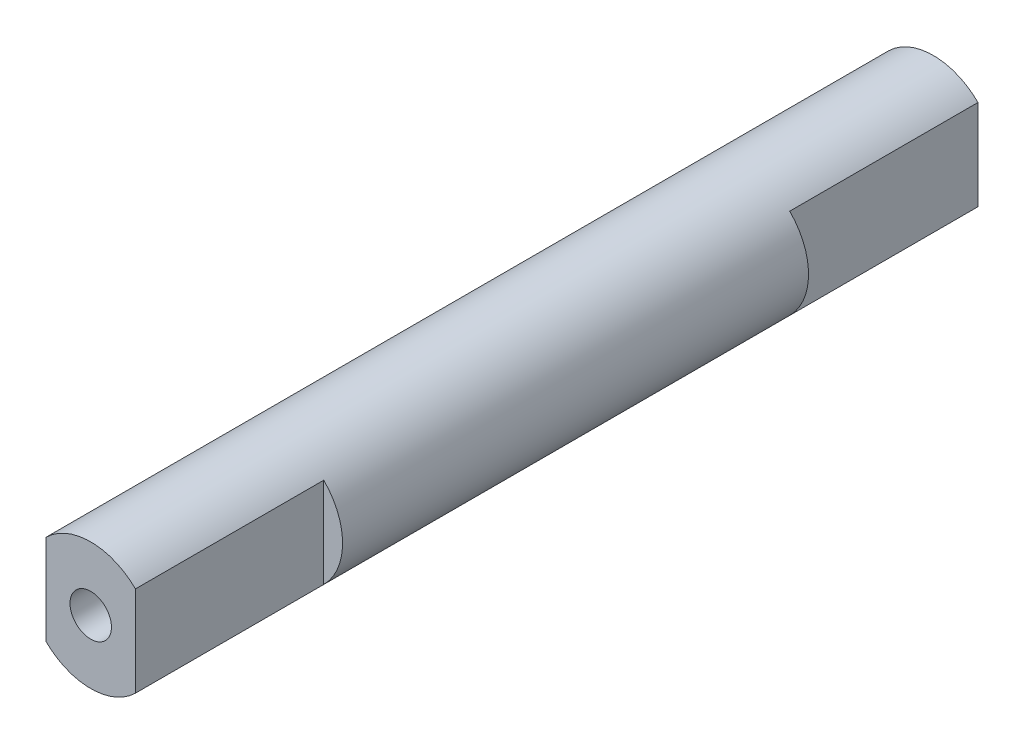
ISO-10303-21;
HEADER;
FILE_DESCRIPTION(('STEP AP214'),'2;1');
FILE_NAME('part.step','',(''),(''),'','','');
FILE_SCHEMA(('AUTOMOTIVE_DESIGN { 1 0 10303 214 1 1 1 1 }'));
ENDSEC;
DATA;
#1=APPLICATION_CONTEXT('core data for automotive mechanical design processes');
#2=APPLICATION_PROTOCOL_DEFINITION('international standard','automotive_design',2000,#1);
#3=PRODUCT_CONTEXT('',#1,'mechanical');
#4=PRODUCT('Part','Part','',(#3));
#5=PRODUCT_RELATED_PRODUCT_CATEGORY('part','',(#4));
#6=PRODUCT_DEFINITION_FORMATION('','',#4);
#7=PRODUCT_DEFINITION_CONTEXT('part definition',#1,'design');
#8=PRODUCT_DEFINITION('design','',#6,#7);
#9=PRODUCT_DEFINITION_SHAPE('','',#8);
#10=(LENGTH_UNIT() NAMED_UNIT(*) SI_UNIT(.MILLI.,.METRE.));
#11=(NAMED_UNIT(*) PLANE_ANGLE_UNIT() SI_UNIT($,.RADIAN.));
#12=(NAMED_UNIT(*) SI_UNIT($,.STERADIAN.) SOLID_ANGLE_UNIT());
#13=UNCERTAINTY_MEASURE_WITH_UNIT(LENGTH_MEASURE(1.E-05),#10,'distance_accuracy_value','');
#14=(GEOMETRIC_REPRESENTATION_CONTEXT(3) GLOBAL_UNCERTAINTY_ASSIGNED_CONTEXT((#13)) GLOBAL_UNIT_ASSIGNED_CONTEXT((#10,
#11,#12)) REPRESENTATION_CONTEXT('',''));
#15=CARTESIAN_POINT('',(0.,0.,0.));
#16=DIRECTION('',(0.,0.,1.));
#17=DIRECTION('',(1.,0.,0.));
#18=AXIS2_PLACEMENT_3D('',#15,#16,#17);
#19=CARTESIAN_POINT('',(0.,0.,-19.296));
#20=DIRECTION('',(0.,0.,-1.));
#21=DIRECTION('',(1.,0.,0.));
#22=AXIS2_PLACEMENT_3D('',#19,#20,#21);
#23=PLANE('',#22);
#24=CARTESIAN_POINT('',(0.,0.,-19.296));
#25=DIRECTION('',(0.,0.,1.));
#26=DIRECTION('',(1.,0.,0.));
#27=AXIS2_PLACEMENT_3D('',#24,#25,#26);
#28=CIRCLE('',#27,2.7);
#29=CARTESIAN_POINT('',(1.9,-1.91833260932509,-19.296));
#30=VERTEX_POINT('',#29);
#31=CARTESIAN_POINT('',(1.9,1.91833260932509,-19.296));
#32=VERTEX_POINT('',#31);
#33=EDGE_CURVE('E110',#30,#32,#28,.T.);
#34=ORIENTED_EDGE('',*,*,#33,.F.);
#35=DIRECTION('',(0.,1.,0.));
#36=VECTOR('',#35,1.);
#37=CARTESIAN_POINT('',(1.9,-1.91833260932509,-19.296));
#38=LINE('',#37,#36);
#39=EDGE_CURVE('E121',#30,#32,#38,.T.);
#40=ORIENTED_EDGE('',*,*,#39,.T.);
#41=EDGE_LOOP('',(#34,#40));
#42=FACE_BOUND('',#41,.T.);
#43=ADVANCED_FACE('F37',(#42),#23,.T.);
#44=CARTESIAN_POINT('',(-1.9,1.91833260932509,-19.296));
#45=VERTEX_POINT('',#44);
#46=CARTESIAN_POINT('',(-1.9,-1.91833260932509,-19.296));
#47=VERTEX_POINT('',#46);
#48=EDGE_CURVE('E109',#45,#47,#28,.T.);
#49=ORIENTED_EDGE('',*,*,#48,.F.);
#50=DIRECTION('',(0.,-1.,0.));
#51=VECTOR('',#50,1.);
#52=CARTESIAN_POINT('',(-1.9,-1.91833260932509,-19.296));
#53=LINE('',#52,#51);
#54=EDGE_CURVE('E136',#45,#47,#53,.T.);
#55=ORIENTED_EDGE('',*,*,#54,.T.);
#56=EDGE_LOOP('',(#49,#55));
#57=FACE_BOUND('',#56,.T.);
#58=ADVANCED_FACE('F215',(#57),#23,.T.);
#59=CARTESIAN_POINT('',(0.,0.,0.5));
#60=DIRECTION('',(0.,0.,1.));
#61=DIRECTION('',(1.,0.,0.));
#62=AXIS2_PLACEMENT_3D('',#59,#60,#61);
#63=PLANE('',#62);
#64=DIRECTION('',(0.,-1.,0.));
#65=VECTOR('',#64,1.);
#66=CARTESIAN_POINT('',(-1.9,-1.91833260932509,0.5));
#67=LINE('',#66,#65);
#68=CARTESIAN_POINT('',(-1.9,1.91833260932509,0.5));
#69=VERTEX_POINT('',#68);
#70=CARTESIAN_POINT('',(-1.9,-1.91833260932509,0.5));
#71=VERTEX_POINT('',#70);
#72=EDGE_CURVE('E158',#69,#71,#67,.T.);
#73=ORIENTED_EDGE('',*,*,#72,.F.);
#74=CARTESIAN_POINT('',(0.,0.,0.5));
#75=DIRECTION('',(0.,0.,1.));
#76=DIRECTION('',(1.,0.,0.));
#77=AXIS2_PLACEMENT_3D('',#74,#75,#76);
#78=CIRCLE('',#77,2.7);
#79=EDGE_CURVE('E11',#69,#71,#78,.T.);
#80=ORIENTED_EDGE('',*,*,#79,.T.);
#81=EDGE_LOOP('',(#73,#80));
#82=FACE_BOUND('',#81,.T.);
#83=ADVANCED_FACE('F207',(#82),#63,.T.);
#84=CARTESIAN_POINT('',(0.,0.,0.5));
#85=DIRECTION('',(0.,0.,-1.));
#86=DIRECTION('',(-1.,0.,0.));
#87=AXIS2_PLACEMENT_3D('',#84,#85,#86);
#88=CYLINDRICAL_SURFACE('',#87,2.7);
#89=ORIENTED_EDGE('',*,*,#79,.F.);
#90=DIRECTION('',(0.,0.,-1.));
#91=VECTOR('',#90,1.);
#92=CARTESIAN_POINT('',(-1.9,1.91833260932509,8.5));
#93=LINE('',#92,#91);
#94=CARTESIAN_POINT('',(-1.9,1.91833260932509,8.5));
#95=VERTEX_POINT('',#94);
#96=EDGE_CURVE('E165',#95,#69,#93,.T.);
#97=ORIENTED_EDGE('',*,*,#96,.F.);
#98=CARTESIAN_POINT('',(0.,0.,8.5));
#99=DIRECTION('',(0.,0.,1.));
#100=DIRECTION('',(1.,0.,0.));
#101=AXIS2_PLACEMENT_3D('',#98,#99,#100);
#102=CIRCLE('',#101,2.7);
#103=CARTESIAN_POINT('',(1.9,1.91833260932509,8.5));
#104=VERTEX_POINT('',#103);
#105=EDGE_CURVE('E237',#104,#95,#102,.T.);
#106=ORIENTED_EDGE('',*,*,#105,.F.);
#107=DIRECTION('',(0.,0.,-1.));
#108=VECTOR('',#107,1.);
#109=CARTESIAN_POINT('',(1.9,1.91833260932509,8.5));
#110=LINE('',#109,#108);
#111=CARTESIAN_POINT('',(1.9,1.91833260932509,0.5));
#112=VERTEX_POINT('',#111);
#113=EDGE_CURVE('E168',#104,#112,#110,.T.);
#114=ORIENTED_EDGE('',*,*,#113,.T.);
#115=CARTESIAN_POINT('',(1.9,-1.91833260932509,0.5));
#116=VERTEX_POINT('',#115);
#117=EDGE_CURVE('E46',#116,#112,#78,.T.);
#118=ORIENTED_EDGE('',*,*,#117,.F.);
#119=DIRECTION('',(0.,0.,-1.));
#120=VECTOR('',#119,1.);
#121=CARTESIAN_POINT('',(1.9,-1.91833260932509,8.5));
#122=LINE('',#121,#120);
#123=CARTESIAN_POINT('',(1.9,-1.91833260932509,8.5));
#124=VERTEX_POINT('',#123);
#125=EDGE_CURVE('E189',#124,#116,#122,.T.);
#126=ORIENTED_EDGE('',*,*,#125,.F.);
#127=CARTESIAN_POINT('',(0.,0.,8.5));
#128=DIRECTION('',(0.,0.,1.));
#129=DIRECTION('',(1.,0.,0.));
#130=AXIS2_PLACEMENT_3D('',#127,#128,#129);
#131=CIRCLE('',#130,2.7);
#132=CARTESIAN_POINT('',(-1.9,-1.91833260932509,8.5));
#133=VERTEX_POINT('',#132);
#134=EDGE_CURVE('E178',#133,#124,#131,.T.);
#135=ORIENTED_EDGE('',*,*,#134,.F.);
#136=DIRECTION('',(0.,0.,-1.));
#137=VECTOR('',#136,1.);
#138=CARTESIAN_POINT('',(-1.9,-1.91833260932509,8.5));
#139=LINE('',#138,#137);
#140=EDGE_CURVE('E169',#133,#71,#139,.T.);
#141=ORIENTED_EDGE('',*,*,#140,.T.);
#142=EDGE_LOOP('',(#89,#97,#106,#114,#118,#126,#135,#141));
#143=FACE_BOUND('',#142,.T.);
#144=ORIENTED_EDGE('',*,*,#33,.T.);
#145=DIRECTION('',(0.,0.,1.));
#146=VECTOR('',#145,1.);
#147=CARTESIAN_POINT('',(1.9,1.91833260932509,-27.296));
#148=LINE('',#147,#146);
#149=CARTESIAN_POINT('',(1.9,1.91833260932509,-27.296));
#150=VERTEX_POINT('',#149);
#151=EDGE_CURVE('E144',#150,#32,#148,.T.);
#152=ORIENTED_EDGE('',*,*,#151,.F.);
#153=CARTESIAN_POINT('',(0.,0.,-27.296));
#154=DIRECTION('',(0.,0.,1.));
#155=DIRECTION('',(1.,0.,0.));
#156=AXIS2_PLACEMENT_3D('',#153,#154,#155);
#157=CIRCLE('',#156,2.7);
#158=CARTESIAN_POINT('',(-1.9,1.91833260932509,-27.296));
#159=VERTEX_POINT('',#158);
#160=EDGE_CURVE('E124',#150,#159,#157,.T.);
#161=ORIENTED_EDGE('',*,*,#160,.T.);
#162=DIRECTION('',(0.,0.,1.));
#163=VECTOR('',#162,1.);
#164=CARTESIAN_POINT('',(-1.9,1.91833260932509,-27.296));
#165=LINE('',#164,#163);
#166=EDGE_CURVE('E111',#159,#45,#165,.T.);
#167=ORIENTED_EDGE('',*,*,#166,.T.);
#168=ORIENTED_EDGE('',*,*,#48,.T.);
#169=DIRECTION('',(0.,0.,1.));
#170=VECTOR('',#169,1.);
#171=CARTESIAN_POINT('',(-1.9,-1.91833260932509,-27.296));
#172=LINE('',#171,#170);
#173=CARTESIAN_POINT('',(-1.9,-1.91833260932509,-27.296));
#174=VERTEX_POINT('',#173);
#175=EDGE_CURVE('E54',#174,#47,#172,.T.);
#176=ORIENTED_EDGE('',*,*,#175,.F.);
#177=CARTESIAN_POINT('',(0.,0.,-27.296));
#178=DIRECTION('',(0.,0.,1.));
#179=DIRECTION('',(1.,0.,0.));
#180=AXIS2_PLACEMENT_3D('',#177,#178,#179);
#181=CIRCLE('',#180,2.7);
#182=CARTESIAN_POINT('',(1.9,-1.91833260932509,-27.296));
#183=VERTEX_POINT('',#182);
#184=EDGE_CURVE('E106',#174,#183,#181,.T.);
#185=ORIENTED_EDGE('',*,*,#184,.T.);
#186=DIRECTION('',(0.,0.,1.));
#187=VECTOR('',#186,1.);
#188=CARTESIAN_POINT('',(1.9,-1.91833260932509,-27.296));
#189=LINE('',#188,#187);
#190=EDGE_CURVE('E130',#183,#30,#189,.T.);
#191=ORIENTED_EDGE('',*,*,#190,.T.);
#192=EDGE_LOOP('',(#144,#152,#161,#167,#168,#176,#185,#191));
#193=FACE_BOUND('',#192,.T.);
#194=ADVANCED_FACE('F39',(#143,#193),#88,.T.);
#195=DIRECTION('',(0.,1.,0.));
#196=VECTOR('',#195,1.);
#197=CARTESIAN_POINT('',(1.9,-1.91833260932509,0.5));
#198=LINE('',#197,#196);
#199=EDGE_CURVE('E61',#116,#112,#198,.T.);
#200=ORIENTED_EDGE('',*,*,#199,.F.);
#201=ORIENTED_EDGE('',*,*,#117,.T.);
#202=EDGE_LOOP('',(#200,#201));
#203=FACE_BOUND('',#202,.T.);
#204=ADVANCED_FACE('F205',(#203),#63,.T.);
#205=CARTESIAN_POINT('',(1.9,-1.91833260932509,8.5));
#206=DIRECTION('',(-1.,0.,0.));
#207=DIRECTION('',(0.,0.,1.));
#208=AXIS2_PLACEMENT_3D('',#205,#206,#207);
#209=PLANE('',#208);
#210=ORIENTED_EDGE('',*,*,#199,.T.);
#211=ORIENTED_EDGE('',*,*,#113,.F.);
#212=DIRECTION('',(0.,1.,0.));
#213=VECTOR('',#212,1.);
#214=CARTESIAN_POINT('',(1.9,-1.91833260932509,8.5));
#215=LINE('',#214,#213);
#216=EDGE_CURVE('E199',#124,#104,#215,.T.);
#217=ORIENTED_EDGE('',*,*,#216,.F.);
#218=ORIENTED_EDGE('',*,*,#125,.T.);
#219=EDGE_LOOP('',(#210,#211,#217,#218));
#220=FACE_BOUND('',#219,.T.);
#221=ADVANCED_FACE('F197',(#220),#209,.F.);
#222=CARTESIAN_POINT('',(-1.9,-1.91833260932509,8.5));
#223=DIRECTION('',(1.,0.,0.));
#224=DIRECTION('',(0.,0.,-1.));
#225=AXIS2_PLACEMENT_3D('',#222,#223,#224);
#226=PLANE('',#225);
#227=ORIENTED_EDGE('',*,*,#72,.T.);
#228=ORIENTED_EDGE('',*,*,#140,.F.);
#229=DIRECTION('',(0.,-1.,0.));
#230=VECTOR('',#229,1.);
#231=CARTESIAN_POINT('',(-1.9,-1.91833260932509,8.5));
#232=LINE('',#231,#230);
#233=EDGE_CURVE('E174',#95,#133,#232,.T.);
#234=ORIENTED_EDGE('',*,*,#233,.F.);
#235=ORIENTED_EDGE('',*,*,#96,.T.);
#236=EDGE_LOOP('',(#227,#228,#234,#235));
#237=FACE_BOUND('',#236,.T.);
#238=ADVANCED_FACE('F212',(#237),#226,.F.);
#239=CARTESIAN_POINT('',(0.,0.,8.5));
#240=DIRECTION('',(0.,0.,1.));
#241=DIRECTION('',(1.,0.,0.));
#242=AXIS2_PLACEMENT_3D('',#239,#240,#241);
#243=PLANE('',#242);
#244=CARTESIAN_POINT('',(0.,0.,8.5));
#245=DIRECTION('',(0.,0.,1.));
#246=DIRECTION('',(1.,0.,0.));
#247=AXIS2_PLACEMENT_3D('',#244,#245,#246);
#248=CIRCLE('',#247,0.88);
#249=CARTESIAN_POINT('',(0.88,0.,8.5));
#250=VERTEX_POINT('',#249);
#251=EDGE_CURVE('E339',#250,#250,#248,.T.);
#252=ORIENTED_EDGE('',*,*,#251,.F.);
#253=EDGE_LOOP('',(#252));
#254=FACE_BOUND('',#253,.T.);
#255=ORIENTED_EDGE('',*,*,#134,.T.);
#256=ORIENTED_EDGE('',*,*,#216,.T.);
#257=ORIENTED_EDGE('',*,*,#105,.T.);
#258=ORIENTED_EDGE('',*,*,#233,.T.);
#259=EDGE_LOOP('',(#255,#256,#257,#258));
#260=FACE_BOUND('',#259,.T.);
#261=ADVANCED_FACE('F226',(#254,#260),#243,.T.);
#262=CARTESIAN_POINT('',(-1.9,-1.91833260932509,-27.296));
#263=DIRECTION('',(-1.,0.,0.));
#264=DIRECTION('',(0.,0.,1.));
#265=AXIS2_PLACEMENT_3D('',#262,#263,#264);
#266=PLANE('',#265);
#267=ORIENTED_EDGE('',*,*,#54,.F.);
#268=ORIENTED_EDGE('',*,*,#166,.F.);
#269=DIRECTION('',(0.,-1.,0.));
#270=VECTOR('',#269,1.);
#271=CARTESIAN_POINT('',(-1.9,-1.91833260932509,-27.296));
#272=LINE('',#271,#270);
#273=EDGE_CURVE('E117',#159,#174,#272,.T.);
#274=ORIENTED_EDGE('',*,*,#273,.T.);
#275=ORIENTED_EDGE('',*,*,#175,.T.);
#276=EDGE_LOOP('',(#267,#268,#274,#275));
#277=FACE_BOUND('',#276,.T.);
#278=ADVANCED_FACE('F123',(#277),#266,.T.);
#279=CARTESIAN_POINT('',(1.9,-1.91833260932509,-27.296));
#280=DIRECTION('',(1.,0.,0.));
#281=DIRECTION('',(0.,0.,-1.));
#282=AXIS2_PLACEMENT_3D('',#279,#280,#281);
#283=PLANE('',#282);
#284=ORIENTED_EDGE('',*,*,#39,.F.);
#285=ORIENTED_EDGE('',*,*,#190,.F.);
#286=DIRECTION('',(0.,1.,0.));
#287=VECTOR('',#286,1.);
#288=CARTESIAN_POINT('',(1.9,-1.91833260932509,-27.296));
#289=LINE('',#288,#287);
#290=EDGE_CURVE('E120',#183,#150,#289,.T.);
#291=ORIENTED_EDGE('',*,*,#290,.T.);
#292=ORIENTED_EDGE('',*,*,#151,.T.);
#293=EDGE_LOOP('',(#284,#285,#291,#292));
#294=FACE_BOUND('',#293,.T.);
#295=ADVANCED_FACE('F156',(#294),#283,.T.);
#296=CARTESIAN_POINT('',(0.,0.,-27.296));
#297=DIRECTION('',(0.,0.,-1.));
#298=DIRECTION('',(1.,0.,0.));
#299=AXIS2_PLACEMENT_3D('',#296,#297,#298);
#300=PLANE('',#299);
#301=CARTESIAN_POINT('',(0.,0.,-27.296));
#302=DIRECTION('',(0.,0.,-1.));
#303=DIRECTION('',(-1.,0.,0.));
#304=AXIS2_PLACEMENT_3D('',#301,#302,#303);
#305=CIRCLE('',#304,0.88);
#306=CARTESIAN_POINT('',(-0.88,0.,-27.296));
#307=VERTEX_POINT('',#306);
#308=EDGE_CURVE('E41',#307,#307,#305,.T.);
#309=ORIENTED_EDGE('',*,*,#308,.F.);
#310=EDGE_LOOP('',(#309));
#311=FACE_BOUND('',#310,.T.);
#312=ORIENTED_EDGE('',*,*,#184,.F.);
#313=ORIENTED_EDGE('',*,*,#273,.F.);
#314=ORIENTED_EDGE('',*,*,#160,.F.);
#315=ORIENTED_EDGE('',*,*,#290,.F.);
#316=EDGE_LOOP('',(#312,#313,#314,#315));
#317=FACE_BOUND('',#316,.T.);
#318=ADVANCED_FACE('F115',(#311,#317),#300,.T.);
#319=CARTESIAN_POINT('',(0.,0.,-27.296025));
#320=DIRECTION('',(0.,0.,1.));
#321=DIRECTION('',(1.,0.,0.));
#322=AXIS2_PLACEMENT_3D('',#319,#320,#321);
#323=CYLINDRICAL_SURFACE('',#322,0.88);
#324=ORIENTED_EDGE('',*,*,#308,.T.);
#325=EDGE_LOOP('',(#324));
#326=FACE_BOUND('',#325,.T.);
#327=ORIENTED_EDGE('',*,*,#251,.T.);
#328=EDGE_LOOP('',(#327));
#329=FACE_BOUND('',#328,.T.);
#330=ADVANCED_FACE('F264',(#326,#329),#323,.F.);
#331=CLOSED_SHELL('',(#43,#58,#83,#194,#204,#221,#238,#261,#278,#295,#318,#330));
#332=MANIFOLD_SOLID_BREP('B2',#331);
#333=ADVANCED_BREP_SHAPE_REPRESENTATION('',(#18,#332),#14);
#334=SHAPE_DEFINITION_REPRESENTATION(#9,#333);
ENDSEC;
END-ISO-10303-21;
